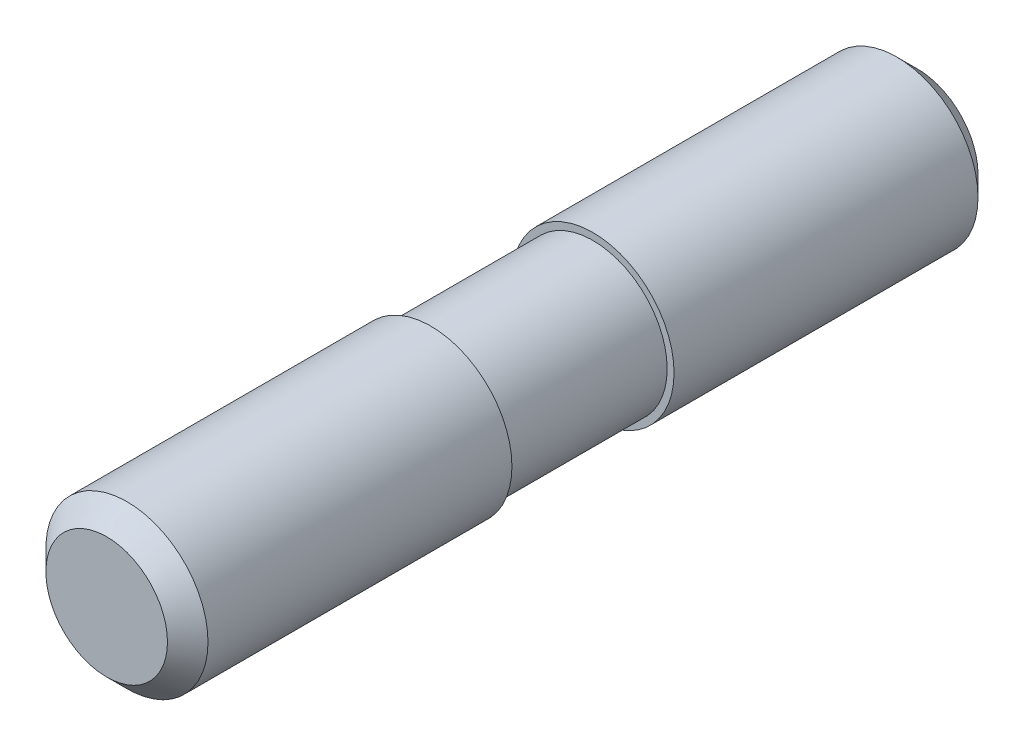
ISO-10303-21;
HEADER;
FILE_DESCRIPTION(('STEP AP214'),'2;1');
FILE_NAME('part.step','',(''),(''),'','','');
FILE_SCHEMA(('AUTOMOTIVE_DESIGN { 1 0 10303 214 1 1 1 1 }'));
ENDSEC;
DATA;
#1=APPLICATION_CONTEXT('core data for automotive mechanical design processes');
#2=APPLICATION_PROTOCOL_DEFINITION('international standard','automotive_design',2000,#1);
#3=PRODUCT_CONTEXT('',#1,'mechanical');
#4=PRODUCT('Part','Part','',(#3));
#5=PRODUCT_RELATED_PRODUCT_CATEGORY('part','',(#4));
#6=PRODUCT_DEFINITION_FORMATION('','',#4);
#7=PRODUCT_DEFINITION_CONTEXT('part definition',#1,'design');
#8=PRODUCT_DEFINITION('design','',#6,#7);
#9=PRODUCT_DEFINITION_SHAPE('','',#8);
#10=(LENGTH_UNIT() NAMED_UNIT(*) SI_UNIT(.MILLI.,.METRE.));
#11=(NAMED_UNIT(*) PLANE_ANGLE_UNIT() SI_UNIT($,.RADIAN.));
#12=(NAMED_UNIT(*) SI_UNIT($,.STERADIAN.) SOLID_ANGLE_UNIT());
#13=UNCERTAINTY_MEASURE_WITH_UNIT(LENGTH_MEASURE(1.E-05),#10,'distance_accuracy_value','');
#14=(GEOMETRIC_REPRESENTATION_CONTEXT(3) GLOBAL_UNCERTAINTY_ASSIGNED_CONTEXT((#13)) GLOBAL_UNIT_ASSIGNED_CONTEXT((#10,
#11,#12)) REPRESENTATION_CONTEXT('',''));
#15=CARTESIAN_POINT('',(0.,0.,0.));
#16=DIRECTION('',(0.,0.,1.));
#17=DIRECTION('',(1.,0.,0.));
#18=AXIS2_PLACEMENT_3D('',#15,#16,#17);
#19=CARTESIAN_POINT('',(0.,0.,0.));
#20=DIRECTION('',(0.,0.,1.));
#21=DIRECTION('',(1.,0.,0.));
#22=AXIS2_PLACEMENT_3D('',#19,#20,#21);
#23=PLANE('',#22);
#24=CARTESIAN_POINT('',(0.,0.,0.));
#25=DIRECTION('',(0.,0.,1.));
#26=DIRECTION('',(1.,0.,0.));
#27=AXIS2_PLACEMENT_3D('',#24,#25,#26);
#28=CIRCLE('',#27,7.5);
#29=CARTESIAN_POINT('',(7.5,0.,0.));
#30=VERTEX_POINT('',#29);
#31=EDGE_CURVE('E8',#30,#30,#28,.T.);
#32=ORIENTED_EDGE('',*,*,#31,.F.);
#33=EDGE_LOOP('',(#32));
#34=FACE_BOUND('',#33,.T.);
#35=ADVANCED_FACE('F12',(#34),#23,.F.);
#36=CARTESIAN_POINT('',(0.,0.,2.5));
#37=DIRECTION('',(0.,0.,1.));
#38=DIRECTION('',(1.,0.,0.));
#39=AXIS2_PLACEMENT_3D('',#36,#37,#38);
#40=CONICAL_SURFACE('',#39,10.,0.785398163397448);
#41=ORIENTED_EDGE('',*,*,#31,.T.);
#42=EDGE_LOOP('',(#41));
#43=FACE_BOUND('',#42,.T.);
#44=CARTESIAN_POINT('',(0.,0.,2.5));
#45=DIRECTION('',(0.,0.,1.));
#46=DIRECTION('',(1.,0.,0.));
#47=AXIS2_PLACEMENT_3D('',#44,#45,#46);
#48=CIRCLE('',#47,10.);
#49=CARTESIAN_POINT('',(10.,0.,2.5));
#50=VERTEX_POINT('',#49);
#51=EDGE_CURVE('E18',#50,#50,#48,.T.);
#52=ORIENTED_EDGE('',*,*,#51,.F.);
#53=EDGE_LOOP('',(#52));
#54=FACE_BOUND('',#53,.T.);
#55=ADVANCED_FACE('F61',(#43,#54),#40,.T.);
#56=CARTESIAN_POINT('',(0.,0.,70.));
#57=DIRECTION('',(0.,0.,1.));
#58=DIRECTION('',(1.,0.,0.));
#59=AXIS2_PLACEMENT_3D('',#56,#57,#58);
#60=CYLINDRICAL_SURFACE('',#59,10.);
#61=CARTESIAN_POINT('',(0.,0.,40.));
#62=DIRECTION('',(0.,0.,1.));
#63=DIRECTION('',(1.,0.,0.));
#64=AXIS2_PLACEMENT_3D('',#61,#62,#63);
#65=CIRCLE('',#64,10.);
#66=CARTESIAN_POINT('',(10.,0.,40.));
#67=VERTEX_POINT('',#66);
#68=EDGE_CURVE('E22',#67,#67,#65,.T.);
#69=ORIENTED_EDGE('',*,*,#68,.F.);
#70=EDGE_LOOP('',(#69));
#71=FACE_BOUND('',#70,.T.);
#72=ORIENTED_EDGE('',*,*,#51,.T.);
#73=EDGE_LOOP('',(#72));
#74=FACE_BOUND('',#73,.T.);
#75=ADVANCED_FACE('F66',(#71,#74),#60,.T.);
#76=CARTESIAN_POINT('',(10.,0.,40.));
#77=DIRECTION('',(0.,0.,-1.));
#78=DIRECTION('',(-1.,0.,0.));
#79=AXIS2_PLACEMENT_3D('',#76,#77,#78);
#80=PLANE('',#79);
#81=CARTESIAN_POINT('',(0.,0.,40.));
#82=DIRECTION('',(0.,0.,1.));
#83=DIRECTION('',(1.,0.,0.));
#84=AXIS2_PLACEMENT_3D('',#81,#82,#83);
#85=CIRCLE('',#84,9.15);
#86=CARTESIAN_POINT('',(9.15,0.,40.));
#87=VERTEX_POINT('',#86);
#88=EDGE_CURVE('E26',#87,#87,#85,.T.);
#89=ORIENTED_EDGE('',*,*,#88,.F.);
#90=EDGE_LOOP('',(#89));
#91=FACE_BOUND('',#90,.T.);
#92=ORIENTED_EDGE('',*,*,#68,.T.);
#93=EDGE_LOOP('',(#92));
#94=FACE_BOUND('',#93,.T.);
#95=ADVANCED_FACE('F70',(#91,#94),#80,.F.);
#96=CARTESIAN_POINT('',(0.,0.,70.));
#97=DIRECTION('',(0.,0.,1.));
#98=DIRECTION('',(1.,0.,0.));
#99=AXIS2_PLACEMENT_3D('',#96,#97,#98);
#100=CYLINDRICAL_SURFACE('',#99,9.15);
#101=CARTESIAN_POINT('',(0.,0.,60.));
#102=DIRECTION('',(0.,0.,1.));
#103=DIRECTION('',(1.,0.,0.));
#104=AXIS2_PLACEMENT_3D('',#101,#102,#103);
#105=CIRCLE('',#104,9.15);
#106=CARTESIAN_POINT('',(9.15,0.,60.));
#107=VERTEX_POINT('',#106);
#108=EDGE_CURVE('E31',#107,#107,#105,.T.);
#109=ORIENTED_EDGE('',*,*,#108,.F.);
#110=EDGE_LOOP('',(#109));
#111=FACE_BOUND('',#110,.T.);
#112=ORIENTED_EDGE('',*,*,#88,.T.);
#113=EDGE_LOOP('',(#112));
#114=FACE_BOUND('',#113,.T.);
#115=ADVANCED_FACE('F77',(#111,#114),#100,.T.);
#116=CARTESIAN_POINT('',(9.15,0.,60.));
#117=DIRECTION('',(0.,0.,1.));
#118=DIRECTION('',(1.,0.,0.));
#119=AXIS2_PLACEMENT_3D('',#116,#117,#118);
#120=PLANE('',#119);
#121=CARTESIAN_POINT('',(0.,0.,60.));
#122=DIRECTION('',(0.,0.,1.));
#123=DIRECTION('',(1.,0.,0.));
#124=AXIS2_PLACEMENT_3D('',#121,#122,#123);
#125=CIRCLE('',#124,10.);
#126=CARTESIAN_POINT('',(10.,0.,60.));
#127=VERTEX_POINT('',#126);
#128=EDGE_CURVE('E34',#127,#127,#125,.T.);
#129=ORIENTED_EDGE('',*,*,#128,.F.);
#130=EDGE_LOOP('',(#129));
#131=FACE_BOUND('',#130,.T.);
#132=ORIENTED_EDGE('',*,*,#108,.T.);
#133=EDGE_LOOP('',(#132));
#134=FACE_BOUND('',#133,.T.);
#135=ADVANCED_FACE('F57',(#131,#134),#120,.F.);
#136=CARTESIAN_POINT('',(0.,0.,70.));
#137=DIRECTION('',(0.,0.,1.));
#138=DIRECTION('',(1.,0.,0.));
#139=AXIS2_PLACEMENT_3D('',#136,#137,#138);
#140=CYLINDRICAL_SURFACE('',#139,10.);
#141=CARTESIAN_POINT('',(0.,0.,97.5));
#142=DIRECTION('',(0.,0.,1.));
#143=DIRECTION('',(1.,0.,0.));
#144=AXIS2_PLACEMENT_3D('',#141,#142,#143);
#145=CIRCLE('',#144,10.);
#146=CARTESIAN_POINT('',(10.,0.,97.5));
#147=VERTEX_POINT('',#146);
#148=EDGE_CURVE('E37',#147,#147,#145,.T.);
#149=ORIENTED_EDGE('',*,*,#148,.F.);
#150=EDGE_LOOP('',(#149));
#151=FACE_BOUND('',#150,.T.);
#152=ORIENTED_EDGE('',*,*,#128,.T.);
#153=EDGE_LOOP('',(#152));
#154=FACE_BOUND('',#153,.T.);
#155=ADVANCED_FACE('F48',(#151,#154),#140,.T.);
#156=CARTESIAN_POINT('',(0.,0.,100.));
#157=DIRECTION('',(0.,0.,-1.));
#158=DIRECTION('',(-1.,0.,0.));
#159=AXIS2_PLACEMENT_3D('',#156,#157,#158);
#160=CONICAL_SURFACE('',#159,7.5,0.785398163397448);
#161=ORIENTED_EDGE('',*,*,#148,.T.);
#162=EDGE_LOOP('',(#161));
#163=FACE_BOUND('',#162,.T.);
#164=CARTESIAN_POINT('',(0.,0.,100.));
#165=DIRECTION('',(0.,0.,1.));
#166=DIRECTION('',(1.,0.,0.));
#167=AXIS2_PLACEMENT_3D('',#164,#165,#166);
#168=CIRCLE('',#167,7.5);
#169=CARTESIAN_POINT('',(7.5,0.,100.));
#170=VERTEX_POINT('',#169);
#171=EDGE_CURVE('E40',#170,#170,#168,.T.);
#172=ORIENTED_EDGE('',*,*,#171,.F.);
#173=EDGE_LOOP('',(#172));
#174=FACE_BOUND('',#173,.T.);
#175=ADVANCED_FACE('F46',(#163,#174),#160,.T.);
#176=CARTESIAN_POINT('',(7.5,0.,100.));
#177=DIRECTION('',(0.,0.,-1.));
#178=DIRECTION('',(-1.,0.,0.));
#179=AXIS2_PLACEMENT_3D('',#176,#177,#178);
#180=PLANE('',#179);
#181=ORIENTED_EDGE('',*,*,#171,.T.);
#182=EDGE_LOOP('',(#181));
#183=FACE_BOUND('',#182,.T.);
#184=ADVANCED_FACE('F44',(#183),#180,.F.);
#185=CLOSED_SHELL('',(#35,#55,#75,#95,#115,#135,#155,#175,#184));
#186=MANIFOLD_SOLID_BREP('B1',#185);
#187=ADVANCED_BREP_SHAPE_REPRESENTATION('',(#18,#186),#14);
#188=SHAPE_DEFINITION_REPRESENTATION(#9,#187);
ENDSEC;
END-ISO-10303-21;
